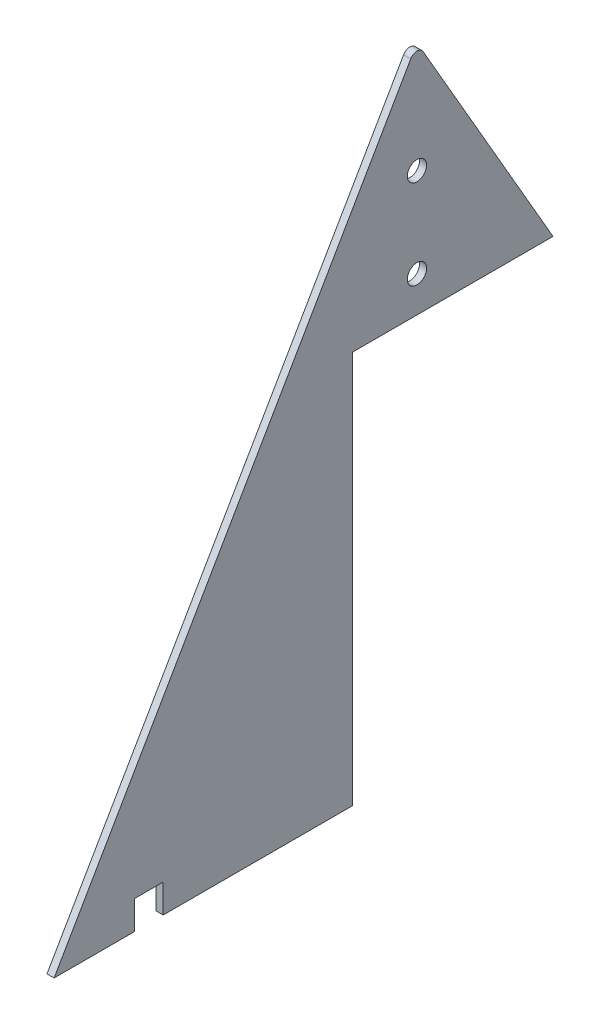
from build123d import *

# Parameters (mm, degrees)
BOSS_EXTRUDE1_DEPTH    = 2
CUT_EXTRUDE1_DEPTH     = 202.507650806
F_5_4_DIAMETER_HOLE2_D = 5.4
SKETCH8_W              = 8
SKETCH8_H              = 8
CUT_EXTRUDE3_DEPTH     = 2


with BuildPart() as part:
    # Sketch1 → Boss-Extrude1 (new body)
    with BuildSketch(Plane(origin=(0, 0, 0), x_dir=(0, 0, -1), z_dir=(1, 0, 0))):
        with BuildLine():
            Line((-1.732050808, 173), (-101.613647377, 0))
            Line((-101.613647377, 0), (0, 0))
            Line((0, 0), (101.613647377, 0))
            Line((101.613647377, 0), (1.732050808, 173))
            ThreePointArc((1.732050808, 173), (0, 174), (-1.732050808, 173))
        make_face()
    extrude(amount=BOSS_EXTRUDE1_DEPTH)

    # Sketch2 → Cut-Extrude1 (cut, through all)
    with BuildSketch(Plane(origin=(2, 0, 0), x_dir=(0, 0, -1), z_dir=(1, 0, 0))):
        Polygon((101.613647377, 0), (38.105117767, 110), (-18, 110), (-18, 0), align=None)
    extrude(amount=-CUT_EXTRUDE1_DEPTH, mode=Mode.SUBTRACT)

    # 5.4_ Diameter Hole2 (through all)
    with Locations(Plane(origin=(2, 0, 0), x_dir=(0, 0, -1), z_dir=(1, 0, 0))):
        with Locations((0, 145), (0, 120)):
            Hole(F_5_4_DIAMETER_HOLE2_D / 2)

    # Sketch8 → Cut-Extrude3 (cut)
    with BuildSketch(Plane.ZY):
        with Locations((75.073448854, 4)):
            Rectangle(SKETCH8_W, SKETCH8_H)
    extrude(amount=-CUT_EXTRUDE3_DEPTH, mode=Mode.SUBTRACT)


solid = part.part
